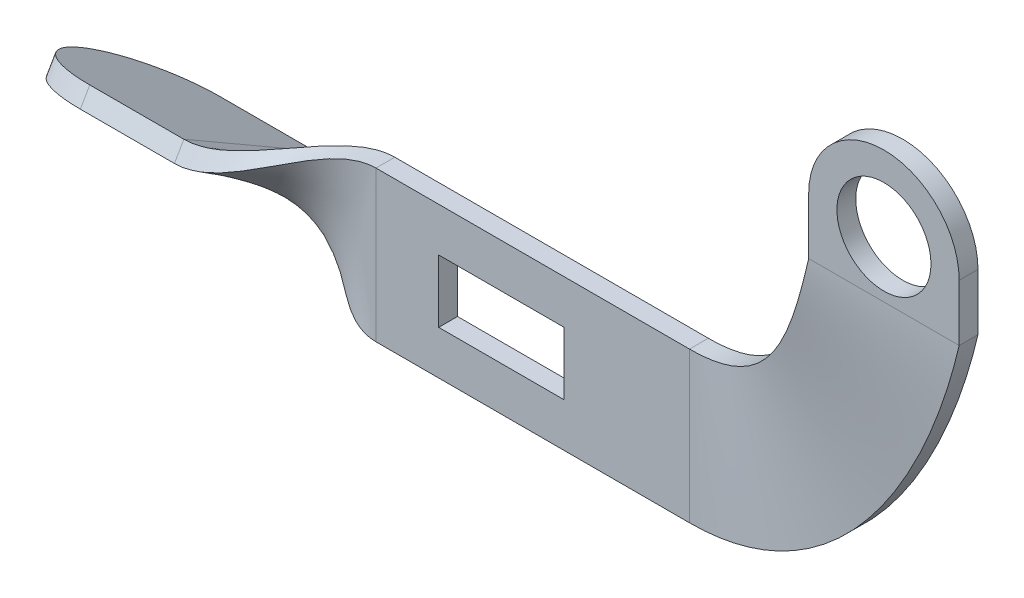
ISO-10303-21;
HEADER;
FILE_DESCRIPTION(('STEP AP214'),'2;1');
FILE_NAME('part.step','',(''),(''),'','','');
FILE_SCHEMA(('AUTOMOTIVE_DESIGN { 1 0 10303 214 1 1 1 1 }'));
ENDSEC;
DATA;
#1=APPLICATION_CONTEXT('core data for automotive mechanical design processes');
#2=APPLICATION_PROTOCOL_DEFINITION('international standard','automotive_design',2000,#1);
#3=PRODUCT_CONTEXT('',#1,'mechanical');
#4=PRODUCT('Part','Part','',(#3));
#5=PRODUCT_RELATED_PRODUCT_CATEGORY('part','',(#4));
#6=PRODUCT_DEFINITION_FORMATION('','',#4);
#7=PRODUCT_DEFINITION_CONTEXT('part definition',#1,'design');
#8=PRODUCT_DEFINITION('design','',#6,#7);
#9=PRODUCT_DEFINITION_SHAPE('','',#8);
#10=(LENGTH_UNIT() NAMED_UNIT(*) SI_UNIT(.MILLI.,.METRE.));
#11=(NAMED_UNIT(*) PLANE_ANGLE_UNIT() SI_UNIT($,.RADIAN.));
#12=(NAMED_UNIT(*) SI_UNIT($,.STERADIAN.) SOLID_ANGLE_UNIT());
#13=UNCERTAINTY_MEASURE_WITH_UNIT(LENGTH_MEASURE(1.E-05),#10,'distance_accuracy_value','');
#14=(GEOMETRIC_REPRESENTATION_CONTEXT(3) GLOBAL_UNCERTAINTY_ASSIGNED_CONTEXT((#13)) GLOBAL_UNIT_ASSIGNED_CONTEXT((#10,
#11,#12)) REPRESENTATION_CONTEXT('',''));
#15=CARTESIAN_POINT('',(0.,0.,0.));
#16=DIRECTION('',(0.,0.,1.));
#17=DIRECTION('',(1.,0.,0.));
#18=AXIS2_PLACEMENT_3D('',#15,#16,#17);
#19=CARTESIAN_POINT('',(0.,24.,60.5226466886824));
#20=DIRECTION('',(0.,0.,1.));
#21=DIRECTION('',(-1.,0.,0.));
#22=AXIS2_PLACEMENT_3D('',#19,#20,#21);
#23=PLANE('',#22);
#24=DIRECTION('',(0.,-1.,0.));
#25=VECTOR('',#24,1.);
#26=CARTESIAN_POINT('',(0.,0.,60.5226466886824));
#27=LINE('',#26,#25);
#28=CARTESIAN_POINT('',(0.,24.,60.5226466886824));
#29=VERTEX_POINT('',#28);
#30=CARTESIAN_POINT('',(0.,0.,60.5226466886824));
#31=VERTEX_POINT('',#30);
#32=EDGE_CURVE('E287',#29,#31,#27,.T.);
#33=ORIENTED_EDGE('',*,*,#32,.F.);
#34=DIRECTION('',(-1.,0.,0.));
#35=VECTOR('',#34,1.);
#36=CARTESIAN_POINT('',(0.,24.,60.5226466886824));
#37=LINE('',#36,#35);
#38=CARTESIAN_POINT('',(50.,24.,60.5226466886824));
#39=VERTEX_POINT('',#38);
#40=EDGE_CURVE('E296',#39,#29,#37,.T.);
#41=ORIENTED_EDGE('',*,*,#40,.F.);
#42=DIRECTION('',(0.,1.,0.));
#43=VECTOR('',#42,1.);
#44=CARTESIAN_POINT('',(50.,0.,60.5226466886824));
#45=LINE('',#44,#43);
#46=CARTESIAN_POINT('',(50.,0.,60.5226466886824));
#47=VERTEX_POINT('',#46);
#48=EDGE_CURVE('E293',#47,#39,#45,.T.);
#49=ORIENTED_EDGE('',*,*,#48,.F.);
#50=DIRECTION('',(1.,0.,0.));
#51=VECTOR('',#50,1.);
#52=CARTESIAN_POINT('',(0.,0.,60.5226466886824));
#53=LINE('',#52,#51);
#54=EDGE_CURVE('E289',#31,#47,#53,.T.);
#55=ORIENTED_EDGE('',*,*,#54,.F.);
#56=EDGE_LOOP('',(#33,#41,#49,#55));
#57=FACE_BOUND('',#56,.T.);
#58=DIRECTION('',(0.,-1.,0.));
#59=VECTOR('',#58,1.);
#60=CARTESIAN_POINT('',(10.,17.,60.5226466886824));
#61=LINE('',#60,#59);
#62=CARTESIAN_POINT('',(10.,17.,60.5226466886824));
#63=VERTEX_POINT('',#62);
#64=CARTESIAN_POINT('',(10.,7.,60.5226466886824));
#65=VERTEX_POINT('',#64);
#66=EDGE_CURVE('E259',#63,#65,#61,.T.);
#67=ORIENTED_EDGE('',*,*,#66,.T.);
#68=DIRECTION('',(1.,0.,0.));
#69=VECTOR('',#68,1.);
#70=CARTESIAN_POINT('',(10.,7.,60.5226466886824));
#71=LINE('',#70,#69);
#72=CARTESIAN_POINT('',(30.,7.,60.5226466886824));
#73=VERTEX_POINT('',#72);
#74=EDGE_CURVE('E262',#65,#73,#71,.T.);
#75=ORIENTED_EDGE('',*,*,#74,.T.);
#76=DIRECTION('',(0.,1.,0.));
#77=VECTOR('',#76,1.);
#78=CARTESIAN_POINT('',(30.,17.,60.5226466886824));
#79=LINE('',#78,#77);
#80=CARTESIAN_POINT('',(30.,17.,60.5226466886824));
#81=VERTEX_POINT('',#80);
#82=EDGE_CURVE('E266',#73,#81,#79,.T.);
#83=ORIENTED_EDGE('',*,*,#82,.T.);
#84=DIRECTION('',(-1.,0.,0.));
#85=VECTOR('',#84,1.);
#86=CARTESIAN_POINT('',(10.,17.,60.5226466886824));
#87=LINE('',#86,#85);
#88=EDGE_CURVE('E269',#81,#63,#87,.T.);
#89=ORIENTED_EDGE('',*,*,#88,.T.);
#90=EDGE_LOOP('',(#67,#75,#83,#89));
#91=FACE_BOUND('',#90,.T.);
#92=ADVANCED_FACE('F31',(#57,#91),#23,.F.);
#93=CARTESIAN_POINT('',(0.,24.,63.5226466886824));
#94=DIRECTION('',(0.,0.,1.));
#95=DIRECTION('',(-1.,0.,0.));
#96=AXIS2_PLACEMENT_3D('',#93,#94,#95);
#97=PLANE('',#96);
#98=DIRECTION('',(0.,-1.,0.));
#99=VECTOR('',#98,1.);
#100=CARTESIAN_POINT('',(0.,0.,63.5226466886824));
#101=LINE('',#100,#99);
#102=CARTESIAN_POINT('',(0.,24.,63.5226466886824));
#103=VERTEX_POINT('',#102);
#104=CARTESIAN_POINT('',(0.,0.,63.5226466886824));
#105=VERTEX_POINT('',#104);
#106=EDGE_CURVE('E286',#103,#105,#101,.T.);
#107=ORIENTED_EDGE('',*,*,#106,.T.);
#108=DIRECTION('',(1.,0.,0.));
#109=VECTOR('',#108,1.);
#110=CARTESIAN_POINT('',(0.,0.,63.5226466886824));
#111=LINE('',#110,#109);
#112=CARTESIAN_POINT('',(50.,0.,63.5226466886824));
#113=VERTEX_POINT('',#112);
#114=EDGE_CURVE('E300',#105,#113,#111,.T.);
#115=ORIENTED_EDGE('',*,*,#114,.T.);
#116=DIRECTION('',(0.,1.,0.));
#117=VECTOR('',#116,1.);
#118=CARTESIAN_POINT('',(50.,0.,63.5226466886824));
#119=LINE('',#118,#117);
#120=CARTESIAN_POINT('',(50.,24.,63.5226466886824));
#121=VERTEX_POINT('',#120);
#122=EDGE_CURVE('E303',#113,#121,#119,.T.);
#123=ORIENTED_EDGE('',*,*,#122,.T.);
#124=DIRECTION('',(-1.,0.,0.));
#125=VECTOR('',#124,1.);
#126=CARTESIAN_POINT('',(0.,24.,63.5226466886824));
#127=LINE('',#126,#125);
#128=EDGE_CURVE('E290',#121,#103,#127,.T.);
#129=ORIENTED_EDGE('',*,*,#128,.T.);
#130=EDGE_LOOP('',(#107,#115,#123,#129));
#131=FACE_BOUND('',#130,.T.);
#132=DIRECTION('',(-1.,0.,0.));
#133=VECTOR('',#132,1.);
#134=CARTESIAN_POINT('',(10.,17.,63.5226466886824));
#135=LINE('',#134,#133);
#136=CARTESIAN_POINT('',(30.,17.,63.5226466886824));
#137=VERTEX_POINT('',#136);
#138=CARTESIAN_POINT('',(10.,17.,63.5226466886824));
#139=VERTEX_POINT('',#138);
#140=EDGE_CURVE('E263',#137,#139,#135,.T.);
#141=ORIENTED_EDGE('',*,*,#140,.F.);
#142=DIRECTION('',(0.,1.,0.));
#143=VECTOR('',#142,1.);
#144=CARTESIAN_POINT('',(30.,17.,63.5226466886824));
#145=LINE('',#144,#143);
#146=CARTESIAN_POINT('',(30.,7.,63.5226466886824));
#147=VERTEX_POINT('',#146);
#148=EDGE_CURVE('E276',#147,#137,#145,.T.);
#149=ORIENTED_EDGE('',*,*,#148,.F.);
#150=DIRECTION('',(1.,0.,0.));
#151=VECTOR('',#150,1.);
#152=CARTESIAN_POINT('',(10.,7.,63.5226466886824));
#153=LINE('',#152,#151);
#154=CARTESIAN_POINT('',(10.,7.,63.5226466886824));
#155=VERTEX_POINT('',#154);
#156=EDGE_CURVE('E273',#155,#147,#153,.T.);
#157=ORIENTED_EDGE('',*,*,#156,.F.);
#158=DIRECTION('',(0.,-1.,0.));
#159=VECTOR('',#158,1.);
#160=CARTESIAN_POINT('',(10.,17.,63.5226466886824));
#161=LINE('',#160,#159);
#162=EDGE_CURVE('E252',#139,#155,#161,.T.);
#163=ORIENTED_EDGE('',*,*,#162,.F.);
#164=EDGE_LOOP('',(#141,#149,#157,#163));
#165=FACE_BOUND('',#164,.T.);
#166=ADVANCED_FACE('F327',(#131,#165),#97,.T.);
#167=CARTESIAN_POINT('',(0.,0.,60.5226466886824));
#168=DIRECTION('',(0.,1.,0.));
#169=DIRECTION('',(0.,0.,-1.));
#170=AXIS2_PLACEMENT_3D('',#167,#168,#169);
#171=PLANE('',#170);
#172=ORIENTED_EDGE('',*,*,#114,.F.);
#173=DIRECTION('',(0.,0.,1.));
#174=VECTOR('',#173,1.);
#175=CARTESIAN_POINT('',(0.,0.,60.5226466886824));
#176=LINE('',#175,#174);
#177=EDGE_CURVE('E11',#31,#105,#176,.T.);
#178=ORIENTED_EDGE('',*,*,#177,.F.);
#179=ORIENTED_EDGE('',*,*,#54,.T.);
#180=DIRECTION('',(0.,0.,1.));
#181=VECTOR('',#180,1.);
#182=CARTESIAN_POINT('',(50.,0.,60.5226466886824));
#183=LINE('',#182,#181);
#184=EDGE_CURVE('E39',#47,#113,#183,.T.);
#185=ORIENTED_EDGE('',*,*,#184,.T.);
#186=EDGE_LOOP('',(#172,#178,#179,#185));
#187=FACE_BOUND('',#186,.T.);
#188=ADVANCED_FACE('F33',(#187),#171,.F.);
#189=CARTESIAN_POINT('',(0.,24.,60.5226466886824));
#190=DIRECTION('',(0.,-1.,0.));
#191=DIRECTION('',(0.,0.,1.));
#192=AXIS2_PLACEMENT_3D('',#189,#190,#191);
#193=PLANE('',#192);
#194=ORIENTED_EDGE('',*,*,#128,.F.);
#195=DIRECTION('',(0.,0.,1.));
#196=VECTOR('',#195,1.);
#197=CARTESIAN_POINT('',(50.,24.,60.5226466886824));
#198=LINE('',#197,#196);
#199=EDGE_CURVE('E309',#39,#121,#198,.T.);
#200=ORIENTED_EDGE('',*,*,#199,.F.);
#201=ORIENTED_EDGE('',*,*,#40,.T.);
#202=DIRECTION('',(0.,0.,1.));
#203=VECTOR('',#202,1.);
#204=CARTESIAN_POINT('',(0.,24.,60.5226466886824));
#205=LINE('',#204,#203);
#206=EDGE_CURVE('E172',#29,#103,#205,.T.);
#207=ORIENTED_EDGE('',*,*,#206,.T.);
#208=EDGE_LOOP('',(#194,#200,#201,#207));
#209=FACE_BOUND('',#208,.T.);
#210=ADVANCED_FACE('F367',(#209),#193,.F.);
#211=CARTESIAN_POINT('',(10.,17.,60.5226466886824));
#212=DIRECTION('',(1.,0.,0.));
#213=DIRECTION('',(0.,0.,1.));
#214=AXIS2_PLACEMENT_3D('',#211,#212,#213);
#215=PLANE('',#214);
#216=ORIENTED_EDGE('',*,*,#162,.T.);
#217=DIRECTION('',(0.,0.,1.));
#218=VECTOR('',#217,1.);
#219=CARTESIAN_POINT('',(10.,7.,60.5226466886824));
#220=LINE('',#219,#218);
#221=EDGE_CURVE('E284',#65,#155,#220,.T.);
#222=ORIENTED_EDGE('',*,*,#221,.F.);
#223=ORIENTED_EDGE('',*,*,#66,.F.);
#224=DIRECTION('',(0.,0.,1.));
#225=VECTOR('',#224,1.);
#226=CARTESIAN_POINT('',(10.,17.,60.5226466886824));
#227=LINE('',#226,#225);
#228=EDGE_CURVE('E54',#63,#139,#227,.T.);
#229=ORIENTED_EDGE('',*,*,#228,.T.);
#230=EDGE_LOOP('',(#216,#222,#223,#229));
#231=FACE_BOUND('',#230,.T.);
#232=ADVANCED_FACE('F369',(#231),#215,.T.);
#233=CARTESIAN_POINT('',(10.,7.,60.5226466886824));
#234=DIRECTION('',(0.,1.,0.));
#235=DIRECTION('',(0.,0.,-1.));
#236=AXIS2_PLACEMENT_3D('',#233,#234,#235);
#237=PLANE('',#236);
#238=ORIENTED_EDGE('',*,*,#156,.T.);
#239=DIRECTION('',(0.,0.,1.));
#240=VECTOR('',#239,1.);
#241=CARTESIAN_POINT('',(30.,7.,60.5226466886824));
#242=LINE('',#241,#240);
#243=EDGE_CURVE('E282',#73,#147,#242,.T.);
#244=ORIENTED_EDGE('',*,*,#243,.F.);
#245=ORIENTED_EDGE('',*,*,#74,.F.);
#246=ORIENTED_EDGE('',*,*,#221,.T.);
#247=EDGE_LOOP('',(#238,#244,#245,#246));
#248=FACE_BOUND('',#247,.T.);
#249=ADVANCED_FACE('F374',(#248),#237,.T.);
#250=CARTESIAN_POINT('',(30.,17.,60.5226466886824));
#251=DIRECTION('',(-1.,0.,0.));
#252=DIRECTION('',(0.,0.,-1.));
#253=AXIS2_PLACEMENT_3D('',#250,#251,#252);
#254=PLANE('',#253);
#255=ORIENTED_EDGE('',*,*,#148,.T.);
#256=DIRECTION('',(0.,0.,1.));
#257=VECTOR('',#256,1.);
#258=CARTESIAN_POINT('',(30.,17.,60.5226466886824));
#259=LINE('',#258,#257);
#260=EDGE_CURVE('E46',#81,#137,#259,.T.);
#261=ORIENTED_EDGE('',*,*,#260,.F.);
#262=ORIENTED_EDGE('',*,*,#82,.F.);
#263=ORIENTED_EDGE('',*,*,#243,.T.);
#264=EDGE_LOOP('',(#255,#261,#262,#263));
#265=FACE_BOUND('',#264,.T.);
#266=ADVANCED_FACE('F385',(#265),#254,.T.);
#267=CARTESIAN_POINT('',(10.,17.,60.5226466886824));
#268=DIRECTION('',(0.,-1.,0.));
#269=DIRECTION('',(0.,0.,1.));
#270=AXIS2_PLACEMENT_3D('',#267,#268,#269);
#271=PLANE('',#270);
#272=ORIENTED_EDGE('',*,*,#140,.T.);
#273=ORIENTED_EDGE('',*,*,#228,.F.);
#274=ORIENTED_EDGE('',*,*,#88,.F.);
#275=ORIENTED_EDGE('',*,*,#260,.T.);
#276=EDGE_LOOP('',(#272,#273,#274,#275));
#277=FACE_BOUND('',#276,.T.);
#278=ADVANCED_FACE('F389',(#277),#271,.T.);
#279=CARTESIAN_POINT('',(79.,56.,73.5226466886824));
#280=CARTESIAN_POINT('',(75.8125972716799,42.4651832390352,73.5226466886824));
#281=CARTESIAN_POINT('',(62.7323307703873,24.,63.5226466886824));
#282=CARTESIAN_POINT('',(50.,24.,63.5226466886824));
#283=CARTESIAN_POINT('',(81.,56.,73.5226466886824));
#284=CARTESIAN_POINT('',(77.6125411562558,41.615675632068,73.5226466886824));
#285=CARTESIAN_POINT('',(63.5510503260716,22.,63.5226466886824));
#286=CARTESIAN_POINT('',(50.,22.,63.5226466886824));
#287=CARTESIAN_POINT('',(85.0000000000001,56.,73.5226466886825));
#288=CARTESIAN_POINT('',(81.2124289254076,39.9166604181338,73.5226466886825));
#289=CARTESIAN_POINT('',(65.1884894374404,18.,63.5226466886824));
#290=CARTESIAN_POINT('',(50.,18.,63.5226466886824));
#291=CARTESIAN_POINT('',(90.9999999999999,56.,73.5226466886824));
#292=CARTESIAN_POINT('',(86.6089116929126,37.3539170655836,73.5226466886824));
#293=CARTESIAN_POINT('',(67.659257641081,12.,63.5226466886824));
#294=CARTESIAN_POINT('',(50.,12.,63.5226466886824));
#295=CARTESIAN_POINT('',(97.0000000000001,56.,73.5226466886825));
#296=CARTESIAN_POINT('',(92.0042255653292,34.7862101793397,73.5226466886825));
#297=CARTESIAN_POINT('',(70.135125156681,5.99999999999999,63.5226466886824));
#298=CARTESIAN_POINT('',(50.,5.99999999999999,63.5226466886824));
#299=CARTESIAN_POINT('',(101.,56.,73.5226466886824));
#300=CARTESIAN_POINT('',(95.6002466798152,33.0707758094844,73.5226466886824));
#301=CARTESIAN_POINT('',(71.7894325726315,2.,63.5226466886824));
#302=CARTESIAN_POINT('',(50.,2.,63.5226466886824));
#303=CARTESIAN_POINT('',(103.,56.,73.5226466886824));
#304=CARTESIAN_POINT('',(97.3982572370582,32.2130586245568,73.5226466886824));
#305=CARTESIAN_POINT('',(72.6165862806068,0.,63.5226466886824));
#306=CARTESIAN_POINT('',(50.,0.,63.5226466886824));
#307=B_SPLINE_SURFACE_WITH_KNOTS('',3,3,((#279,#280,#281,#282),(#283,#284,#285,#286),(#287,#288,
#289,#290),(#291,#292,#293,#294),(#295,#296,#297,#298),(#299,#300,#301,#302),(#303,#304,#305,
#306)),.UNSPECIFIED.,.F.,.F.,.F.,(4,1,1,1,4),(4,4),(0.,0.25,0.5,0.75,1.),(0.,1.),.UNSPECIFIED.);
#308=DIRECTION('',(1.,0.,0.));
#309=VECTOR('',#308,1.);
#310=CARTESIAN_POINT('',(90.9999999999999,56.,73.5226466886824));
#311=LINE('',#310,#309);
#312=CARTESIAN_POINT('',(79.,56.,73.5226466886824));
#313=VERTEX_POINT('',#312);
#314=CARTESIAN_POINT('',(103.,56.,73.5226466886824));
#315=VERTEX_POINT('',#314);
#316=EDGE_CURVE('E230',#313,#315,#311,.T.);
#317=CARTESIAN_POINT('',(79.,56.,73.5226466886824));
#318=CARTESIAN_POINT('',(75.8125972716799,42.4651832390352,73.5226466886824));
#319=CARTESIAN_POINT('',(62.7323307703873,24.,63.5226466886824));
#320=CARTESIAN_POINT('',(50.,24.,63.5226466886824));
#321=B_SPLINE_CURVE_WITH_KNOTS('',3,(#317,#318,#319,#320),.UNSPECIFIED.,.F.,.F.,(4,4),(0.,1.),.UNSPECIFIED.);
#322=EDGE_CURVE('E218',#313,#121,#321,.T.);
#323=CARTESIAN_POINT('',(103.,56.,73.5226466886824));
#324=CARTESIAN_POINT('',(97.3982572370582,32.2130586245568,73.5226466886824));
#325=CARTESIAN_POINT('',(72.6165862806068,0.,63.5226466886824));
#326=CARTESIAN_POINT('',(50.,0.,63.5226466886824));
#327=B_SPLINE_CURVE_WITH_KNOTS('',3,(#323,#324,#325,#326),.UNSPECIFIED.,.F.,.F.,(4,4),(0.,1.),.UNSPECIFIED.);
#328=EDGE_CURVE('E223',#315,#113,#327,.T.);
#329=ORIENTED_EDGE('',*,*,#316,.F.);
#330=ORIENTED_EDGE('',*,*,#322,.T.);
#331=ORIENTED_EDGE('',*,*,#122,.F.);
#332=ORIENTED_EDGE('',*,*,#328,.F.);
#333=EDGE_LOOP('',(#329,#330,#331,#332));
#334=FACE_BOUND('',#333,.T.);
#335=ADVANCED_FACE('F324',(#334),#307,.F.);
#336=CARTESIAN_POINT('',(103.,56.,73.5226466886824));
#337=CARTESIAN_POINT('',(97.3982572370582,32.2130586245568,73.5226466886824));
#338=CARTESIAN_POINT('',(72.6165862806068,0.,63.5226466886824));
#339=CARTESIAN_POINT('',(50.,0.,63.5226466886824));
#340=CARTESIAN_POINT('',(103.,56.,73.2726466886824));
#341=CARTESIAN_POINT('',(97.3982572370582,32.2130586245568,73.2726466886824));
#342=CARTESIAN_POINT('',(72.6165862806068,0.,63.2726466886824));
#343=CARTESIAN_POINT('',(50.,0.,63.2726466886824));
#344=CARTESIAN_POINT('',(103.,56.,72.7726466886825));
#345=CARTESIAN_POINT('',(97.3982572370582,32.2130586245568,72.7726466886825));
#346=CARTESIAN_POINT('',(72.6165862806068,0.,62.7726466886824));
#347=CARTESIAN_POINT('',(50.,0.,62.7726466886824));
#348=CARTESIAN_POINT('',(103.,56.,72.0226466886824));
#349=CARTESIAN_POINT('',(97.3982572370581,32.2130586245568,72.0226466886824));
#350=CARTESIAN_POINT('',(72.6165862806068,0.,62.0226466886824));
#351=CARTESIAN_POINT('',(50.,0.,62.0226466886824));
#352=CARTESIAN_POINT('',(103.,56.,71.2726466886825));
#353=CARTESIAN_POINT('',(97.3982572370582,32.2130586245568,71.2726466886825));
#354=CARTESIAN_POINT('',(72.6165862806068,0.,61.2726466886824));
#355=CARTESIAN_POINT('',(50.,0.,61.2726466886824));
#356=CARTESIAN_POINT('',(103.,56.,70.7726466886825));
#357=CARTESIAN_POINT('',(97.3982572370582,32.2130586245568,70.7726466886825));
#358=CARTESIAN_POINT('',(72.6165862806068,0.,60.7726466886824));
#359=CARTESIAN_POINT('',(50.,0.,60.7726466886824));
#360=CARTESIAN_POINT('',(103.,56.,70.5226466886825));
#361=CARTESIAN_POINT('',(97.3982572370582,32.2130586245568,70.5226466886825));
#362=CARTESIAN_POINT('',(72.6165862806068,0.,60.5226466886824));
#363=CARTESIAN_POINT('',(50.,0.,60.5226466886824));
#364=B_SPLINE_SURFACE_WITH_KNOTS('',3,3,((#336,#337,#338,#339),(#340,#341,#342,#343),(#344,#345,
#346,#347),(#348,#349,#350,#351),(#352,#353,#354,#355),(#356,#357,#358,#359),(#360,#361,#362,
#363)),.UNSPECIFIED.,.F.,.F.,.F.,(4,1,1,1,4),(4,4),(0.,0.25,0.5,0.75,1.),(0.,1.),.UNSPECIFIED.);
#365=DIRECTION('',(0.,0.,-1.));
#366=VECTOR('',#365,1.);
#367=CARTESIAN_POINT('',(103.,56.,72.0226466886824));
#368=LINE('',#367,#366);
#369=CARTESIAN_POINT('',(103.,56.,70.5226466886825));
#370=VERTEX_POINT('',#369);
#371=EDGE_CURVE('E231',#315,#370,#368,.T.);
#372=CARTESIAN_POINT('',(103.,56.,70.5226466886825));
#373=CARTESIAN_POINT('',(97.3982572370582,32.2130586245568,70.5226466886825));
#374=CARTESIAN_POINT('',(72.6165862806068,0.,60.5226466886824));
#375=CARTESIAN_POINT('',(50.,0.,60.5226466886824));
#376=B_SPLINE_CURVE_WITH_KNOTS('',3,(#372,#373,#374,#375),.UNSPECIFIED.,.F.,.F.,(4,4),(0.,1.),.UNSPECIFIED.);
#377=EDGE_CURVE('E232',#370,#47,#376,.T.);
#378=ORIENTED_EDGE('',*,*,#371,.F.);
#379=ORIENTED_EDGE('',*,*,#328,.T.);
#380=ORIENTED_EDGE('',*,*,#184,.F.);
#381=ORIENTED_EDGE('',*,*,#377,.F.);
#382=EDGE_LOOP('',(#378,#379,#380,#381));
#383=FACE_BOUND('',#382,.T.);
#384=ADVANCED_FACE('F348',(#383),#364,.F.);
#385=CARTESIAN_POINT('',(103.,56.,70.5226466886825));
#386=CARTESIAN_POINT('',(97.3982572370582,32.2130586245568,70.5226466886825));
#387=CARTESIAN_POINT('',(72.6165862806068,0.,60.5226466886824));
#388=CARTESIAN_POINT('',(50.,0.,60.5226466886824));
#389=CARTESIAN_POINT('',(101.,56.,70.5226466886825));
#390=CARTESIAN_POINT('',(95.6002466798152,33.0707758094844,70.5226466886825));
#391=CARTESIAN_POINT('',(71.7894325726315,2.,60.5226466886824));
#392=CARTESIAN_POINT('',(50.,2.,60.5226466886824));
#393=CARTESIAN_POINT('',(97.0000000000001,56.,70.5226466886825));
#394=CARTESIAN_POINT('',(92.0042255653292,34.7862101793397,70.5226466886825));
#395=CARTESIAN_POINT('',(70.135125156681,6.,60.5226466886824));
#396=CARTESIAN_POINT('',(50.,6.,60.5226466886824));
#397=CARTESIAN_POINT('',(90.9999999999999,56.,70.5226466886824));
#398=CARTESIAN_POINT('',(86.6089116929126,37.3539170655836,70.5226466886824));
#399=CARTESIAN_POINT('',(67.659257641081,12.,60.5226466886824));
#400=CARTESIAN_POINT('',(50.,12.,60.5226466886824));
#401=CARTESIAN_POINT('',(85.,56.,70.5226466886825));
#402=CARTESIAN_POINT('',(81.2124289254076,39.9166604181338,70.5226466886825));
#403=CARTESIAN_POINT('',(65.1884894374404,18.,60.5226466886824));
#404=CARTESIAN_POINT('',(50.,18.,60.5226466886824));
#405=CARTESIAN_POINT('',(81.,56.,70.5226466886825));
#406=CARTESIAN_POINT('',(77.6125411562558,41.615675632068,70.5226466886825));
#407=CARTESIAN_POINT('',(63.5510503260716,22.,60.5226466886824));
#408=CARTESIAN_POINT('',(50.,22.,60.5226466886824));
#409=CARTESIAN_POINT('',(79.,56.,70.5226466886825));
#410=CARTESIAN_POINT('',(75.8125972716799,42.4651832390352,70.5226466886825));
#411=CARTESIAN_POINT('',(62.7323307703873,24.,60.5226466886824));
#412=CARTESIAN_POINT('',(50.,24.,60.5226466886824));
#413=B_SPLINE_SURFACE_WITH_KNOTS('',3,3,((#385,#386,#387,#388),(#389,#390,#391,#392),(#393,#394,
#395,#396),(#397,#398,#399,#400),(#401,#402,#403,#404),(#405,#406,#407,#408),(#409,#410,#411,
#412)),.UNSPECIFIED.,.F.,.F.,.F.,(4,1,1,1,4),(4,4),(0.,0.25,0.5,0.75,1.),(0.,1.),.UNSPECIFIED.);
#414=DIRECTION('',(-1.,0.,0.));
#415=VECTOR('',#414,1.);
#416=CARTESIAN_POINT('',(90.9999999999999,56.,70.5226466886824));
#417=LINE('',#416,#415);
#418=CARTESIAN_POINT('',(79.,56.,70.5226466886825));
#419=VERTEX_POINT('',#418);
#420=EDGE_CURVE('E239',#370,#419,#417,.T.);
#421=CARTESIAN_POINT('',(79.,56.,70.5226466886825));
#422=CARTESIAN_POINT('',(75.8125972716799,42.4651832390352,70.5226466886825));
#423=CARTESIAN_POINT('',(62.7323307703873,24.,60.5226466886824));
#424=CARTESIAN_POINT('',(50.,24.,60.5226466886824));
#425=B_SPLINE_CURVE_WITH_KNOTS('',3,(#421,#422,#423,#424),.UNSPECIFIED.,.F.,.F.,(4,4),(0.,1.),.UNSPECIFIED.);
#426=EDGE_CURVE('E240',#419,#39,#425,.T.);
#427=ORIENTED_EDGE('',*,*,#420,.F.);
#428=ORIENTED_EDGE('',*,*,#377,.T.);
#429=ORIENTED_EDGE('',*,*,#48,.T.);
#430=ORIENTED_EDGE('',*,*,#426,.F.);
#431=EDGE_LOOP('',(#427,#428,#429,#430));
#432=FACE_BOUND('',#431,.T.);
#433=ADVANCED_FACE('F346',(#432),#413,.F.);
#434=CARTESIAN_POINT('',(79.,56.,70.5226466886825));
#435=CARTESIAN_POINT('',(75.8125972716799,42.4651832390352,70.5226466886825));
#436=CARTESIAN_POINT('',(62.7323307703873,24.,60.5226466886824));
#437=CARTESIAN_POINT('',(50.,24.,60.5226466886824));
#438=CARTESIAN_POINT('',(79.,56.,70.7726466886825));
#439=CARTESIAN_POINT('',(75.8125972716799,42.4651832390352,70.7726466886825));
#440=CARTESIAN_POINT('',(62.7323307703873,24.,60.7726466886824));
#441=CARTESIAN_POINT('',(50.,24.,60.7726466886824));
#442=CARTESIAN_POINT('',(79.,56.,71.2726466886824));
#443=CARTESIAN_POINT('',(75.8125972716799,42.4651832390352,71.2726466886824));
#444=CARTESIAN_POINT('',(62.7323307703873,24.,61.2726466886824));
#445=CARTESIAN_POINT('',(50.,24.,61.2726466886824));
#446=CARTESIAN_POINT('',(78.9999999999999,56.,72.0226466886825));
#447=CARTESIAN_POINT('',(75.8125972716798,42.4651832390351,72.0226466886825));
#448=CARTESIAN_POINT('',(62.7323307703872,24.,62.0226466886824));
#449=CARTESIAN_POINT('',(50.,24.,62.0226466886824));
#450=CARTESIAN_POINT('',(79.,56.,72.7726466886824));
#451=CARTESIAN_POINT('',(75.8125972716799,42.4651832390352,72.7726466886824));
#452=CARTESIAN_POINT('',(62.7323307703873,24.,62.7726466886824));
#453=CARTESIAN_POINT('',(50.,24.,62.7726466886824));
#454=CARTESIAN_POINT('',(79.,56.,73.2726466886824));
#455=CARTESIAN_POINT('',(75.8125972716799,42.4651832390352,73.2726466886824));
#456=CARTESIAN_POINT('',(62.7323307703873,24.,63.2726466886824));
#457=CARTESIAN_POINT('',(50.,24.,63.2726466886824));
#458=CARTESIAN_POINT('',(79.,56.,73.5226466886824));
#459=CARTESIAN_POINT('',(75.8125972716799,42.4651832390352,73.5226466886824));
#460=CARTESIAN_POINT('',(62.7323307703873,24.,63.5226466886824));
#461=CARTESIAN_POINT('',(50.,24.,63.5226466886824));
#462=B_SPLINE_SURFACE_WITH_KNOTS('',3,3,((#434,#435,#436,#437),(#438,#439,#440,#441),(#442,#443,
#444,#445),(#446,#447,#448,#449),(#450,#451,#452,#453),(#454,#455,#456,#457),(#458,#459,#460,
#461)),.UNSPECIFIED.,.F.,.F.,.F.,(4,1,1,1,4),(4,4),(0.,0.25,0.5,0.75,1.),(0.,1.),.UNSPECIFIED.);
#463=DIRECTION('',(0.,0.,1.));
#464=VECTOR('',#463,1.);
#465=CARTESIAN_POINT('',(79.,56.,72.0226466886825));
#466=LINE('',#465,#464);
#467=EDGE_CURVE('E222',#419,#313,#466,.T.);
#468=ORIENTED_EDGE('',*,*,#467,.F.);
#469=ORIENTED_EDGE('',*,*,#426,.T.);
#470=ORIENTED_EDGE('',*,*,#199,.T.);
#471=ORIENTED_EDGE('',*,*,#322,.F.);
#472=EDGE_LOOP('',(#468,#469,#470,#471));
#473=FACE_BOUND('',#472,.T.);
#474=ADVANCED_FACE('F364',(#473),#462,.F.);
#475=CARTESIAN_POINT('',(91.,65.,70.5226466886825));
#476=DIRECTION('',(0.,0.,-1.));
#477=DIRECTION('',(1.,0.,0.));
#478=AXIS2_PLACEMENT_3D('',#475,#476,#477);
#479=PLANE('',#478);
#480=CARTESIAN_POINT('',(91.,65.,70.5226466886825));
#481=DIRECTION('',(0.,0.,1.));
#482=DIRECTION('',(1.,0.,0.));
#483=AXIS2_PLACEMENT_3D('',#480,#481,#482);
#484=CIRCLE('',#483,12.);
#485=CARTESIAN_POINT('',(103.,65.,70.5226466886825));
#486=VERTEX_POINT('',#485);
#487=CARTESIAN_POINT('',(79.,65.,70.5226466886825));
#488=VERTEX_POINT('',#487);
#489=EDGE_CURVE('E199',#486,#488,#484,.T.);
#490=ORIENTED_EDGE('',*,*,#489,.F.);
#491=DIRECTION('',(0.,1.,0.));
#492=VECTOR('',#491,1.);
#493=CARTESIAN_POINT('',(103.,65.,70.5226466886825));
#494=LINE('',#493,#492);
#495=EDGE_CURVE('E205',#370,#486,#494,.T.);
#496=ORIENTED_EDGE('',*,*,#495,.F.);
#497=ORIENTED_EDGE('',*,*,#420,.T.);
#498=DIRECTION('',(0.,-1.,0.));
#499=VECTOR('',#498,1.);
#500=CARTESIAN_POINT('',(79.,56.,70.5226466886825));
#501=LINE('',#500,#499);
#502=EDGE_CURVE('E202',#488,#419,#501,.T.);
#503=ORIENTED_EDGE('',*,*,#502,.F.);
#504=EDGE_LOOP('',(#490,#496,#497,#503));
#505=FACE_BOUND('',#504,.T.);
#506=CARTESIAN_POINT('',(91.,65.,70.5226466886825));
#507=DIRECTION('',(0.,0.,1.));
#508=DIRECTION('',(1.,0.,0.));
#509=AXIS2_PLACEMENT_3D('',#506,#507,#508);
#510=CIRCLE('',#509,7.5);
#511=CARTESIAN_POINT('',(98.5,65.,70.5226466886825));
#512=VERTEX_POINT('',#511);
#513=EDGE_CURVE('E182',#512,#512,#510,.T.);
#514=ORIENTED_EDGE('',*,*,#513,.T.);
#515=EDGE_LOOP('',(#514));
#516=FACE_BOUND('',#515,.T.);
#517=ADVANCED_FACE('F397',(#505,#516),#479,.T.);
#518=CARTESIAN_POINT('',(91.,65.,73.5226466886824));
#519=DIRECTION('',(0.,0.,-1.));
#520=DIRECTION('',(1.,0.,0.));
#521=AXIS2_PLACEMENT_3D('',#518,#519,#520);
#522=PLANE('',#521);
#523=CARTESIAN_POINT('',(91.,65.,73.5226466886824));
#524=DIRECTION('',(0.,0.,1.));
#525=DIRECTION('',(1.,0.,0.));
#526=AXIS2_PLACEMENT_3D('',#523,#524,#525);
#527=CIRCLE('',#526,12.);
#528=CARTESIAN_POINT('',(103.,65.,73.5226466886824));
#529=VERTEX_POINT('',#528);
#530=CARTESIAN_POINT('',(79.,65.,73.5226466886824));
#531=VERTEX_POINT('',#530);
#532=EDGE_CURVE('E197',#529,#531,#527,.T.);
#533=ORIENTED_EDGE('',*,*,#532,.T.);
#534=DIRECTION('',(0.,-1.,0.));
#535=VECTOR('',#534,1.);
#536=CARTESIAN_POINT('',(79.,56.,73.5226466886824));
#537=LINE('',#536,#535);
#538=EDGE_CURVE('E211',#531,#313,#537,.T.);
#539=ORIENTED_EDGE('',*,*,#538,.T.);
#540=ORIENTED_EDGE('',*,*,#316,.T.);
#541=DIRECTION('',(0.,1.,0.));
#542=VECTOR('',#541,1.);
#543=CARTESIAN_POINT('',(103.,65.,73.5226466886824));
#544=LINE('',#543,#542);
#545=EDGE_CURVE('E203',#315,#529,#544,.T.);
#546=ORIENTED_EDGE('',*,*,#545,.T.);
#547=EDGE_LOOP('',(#533,#539,#540,#546));
#548=FACE_BOUND('',#547,.T.);
#549=CARTESIAN_POINT('',(91.,65.,73.5226466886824));
#550=DIRECTION('',(0.,0.,1.));
#551=DIRECTION('',(1.,0.,0.));
#552=AXIS2_PLACEMENT_3D('',#549,#550,#551);
#553=CIRCLE('',#552,7.5);
#554=CARTESIAN_POINT('',(98.5,65.,73.5226466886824));
#555=VERTEX_POINT('',#554);
#556=EDGE_CURVE('E179',#555,#555,#553,.T.);
#557=ORIENTED_EDGE('',*,*,#556,.F.);
#558=EDGE_LOOP('',(#557));
#559=FACE_BOUND('',#558,.T.);
#560=ADVANCED_FACE('F354',(#548,#559),#522,.F.);
#561=CARTESIAN_POINT('',(91.,65.,70.5226466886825));
#562=DIRECTION('',(0.,0.,1.));
#563=DIRECTION('',(-1.,0.,0.));
#564=AXIS2_PLACEMENT_3D('',#561,#562,#563);
#565=CYLINDRICAL_SURFACE('',#564,12.);
#566=ORIENTED_EDGE('',*,*,#532,.F.);
#567=DIRECTION('',(0.,0.,1.));
#568=VECTOR('',#567,1.);
#569=CARTESIAN_POINT('',(103.,65.,70.5226466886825));
#570=LINE('',#569,#568);
#571=EDGE_CURVE('E208',#486,#529,#570,.T.);
#572=ORIENTED_EDGE('',*,*,#571,.F.);
#573=ORIENTED_EDGE('',*,*,#489,.T.);
#574=DIRECTION('',(0.,0.,1.));
#575=VECTOR('',#574,1.);
#576=CARTESIAN_POINT('',(79.,65.,70.5226466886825));
#577=LINE('',#576,#575);
#578=EDGE_CURVE('E216',#488,#531,#577,.T.);
#579=ORIENTED_EDGE('',*,*,#578,.T.);
#580=EDGE_LOOP('',(#566,#572,#573,#579));
#581=FACE_BOUND('',#580,.T.);
#582=ADVANCED_FACE('F357',(#581),#565,.T.);
#583=CARTESIAN_POINT('',(79.,56.,70.5226466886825));
#584=DIRECTION('',(1.,0.,0.));
#585=DIRECTION('',(0.,1.,0.));
#586=AXIS2_PLACEMENT_3D('',#583,#584,#585);
#587=PLANE('',#586);
#588=ORIENTED_EDGE('',*,*,#538,.F.);
#589=ORIENTED_EDGE('',*,*,#578,.F.);
#590=ORIENTED_EDGE('',*,*,#502,.T.);
#591=ORIENTED_EDGE('',*,*,#467,.T.);
#592=EDGE_LOOP('',(#588,#589,#590,#591));
#593=FACE_BOUND('',#592,.T.);
#594=ADVANCED_FACE('F361',(#593),#587,.F.);
#595=CARTESIAN_POINT('',(103.,65.,70.5226466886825));
#596=DIRECTION('',(-1.,0.,0.));
#597=DIRECTION('',(0.,0.,-1.));
#598=AXIS2_PLACEMENT_3D('',#595,#596,#597);
#599=PLANE('',#598);
#600=ORIENTED_EDGE('',*,*,#545,.F.);
#601=ORIENTED_EDGE('',*,*,#371,.T.);
#602=ORIENTED_EDGE('',*,*,#495,.T.);
#603=ORIENTED_EDGE('',*,*,#571,.T.);
#604=EDGE_LOOP('',(#600,#601,#602,#603));
#605=FACE_BOUND('',#604,.T.);
#606=ADVANCED_FACE('F350',(#605),#599,.F.);
#607=CARTESIAN_POINT('',(91.,65.,70.5226466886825));
#608=DIRECTION('',(0.,0.,1.));
#609=DIRECTION('',(-1.,0.,0.));
#610=AXIS2_PLACEMENT_3D('',#607,#608,#609);
#611=CYLINDRICAL_SURFACE('',#610,7.5);
#612=ORIENTED_EDGE('',*,*,#513,.F.);
#613=EDGE_LOOP('',(#612));
#614=FACE_BOUND('',#613,.T.);
#615=ORIENTED_EDGE('',*,*,#556,.T.);
#616=EDGE_LOOP('',(#615));
#617=FACE_BOUND('',#616,.T.);
#618=ADVANCED_FACE('F436',(#614,#617),#611,.F.);
#619=CARTESIAN_POINT('',(-24.,16.7009618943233,71.6649515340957));
#620=CARTESIAN_POINT('',(-15.5252560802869,16.7009618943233,71.6649515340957));
#621=CARTESIAN_POINT('',(-8.47474391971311,24.,63.5226466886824));
#622=CARTESIAN_POINT('',(0.,24.,63.5226466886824));
#623=CARTESIAN_POINT('',(-24.,16.9174682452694,71.5399515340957));
#624=CARTESIAN_POINT('',(-15.5291183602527,16.9174682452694,71.5399515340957));
#625=CARTESIAN_POINT('',(-8.47088163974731,24.,63.2726466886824));
#626=CARTESIAN_POINT('',(0.,24.,63.2726466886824));
#627=CARTESIAN_POINT('',(-24.,17.3504809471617,71.2899515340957));
#628=CARTESIAN_POINT('',(-15.5368429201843,17.3504809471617,71.2899515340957));
#629=CARTESIAN_POINT('',(-8.4631570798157,24.,62.7726466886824));
#630=CARTESIAN_POINT('',(0.,24.,62.7726466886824));
#631=CARTESIAN_POINT('',(-24.,18.,70.9149515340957));
#632=CARTESIAN_POINT('',(-15.5429576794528,18.,70.9149515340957));
#633=CARTESIAN_POINT('',(-8.4570423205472,24.,62.0226466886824));
#634=CARTESIAN_POINT('',(0.,24.,62.0226466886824));
#635=CARTESIAN_POINT('',(-24.,18.6495190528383,70.5399515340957));
#636=CARTESIAN_POINT('',(-15.5454035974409,18.6495190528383,70.5399515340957));
#637=CARTESIAN_POINT('',(-8.45459640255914,24.,61.2726466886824));
#638=CARTESIAN_POINT('',(0.,24.,61.2726466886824));
#639=CARTESIAN_POINT('',(-24.,19.0825317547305,70.2899515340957));
#640=CARTESIAN_POINT('',(-15.5433653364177,19.0825317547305,70.2899515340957));
#641=CARTESIAN_POINT('',(-8.45663466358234,24.,60.7726466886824));
#642=CARTESIAN_POINT('',(0.,24.,60.7726466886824));
#643=CARTESIAN_POINT('',(-24.,19.2990381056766,70.1649515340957));
#644=CARTESIAN_POINT('',(-15.5423462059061,19.2990381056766,70.1649515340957));
#645=CARTESIAN_POINT('',(-8.45765379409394,24.,60.5226466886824));
#646=CARTESIAN_POINT('',(0.,24.,60.5226466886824));
#647=B_SPLINE_SURFACE_WITH_KNOTS('',3,3,((#619,#620,#621,#622),(#623,#624,#625,#626),(#627,#628,
#629,#630),(#631,#632,#633,#634),(#635,#636,#637,#638),(#639,#640,#641,#642),(#643,#644,#645,
#646)),.UNSPECIFIED.,.F.,.F.,.F.,(4,1,1,1,4),(4,4),(0.,0.25,0.5,0.75,1.),(0.,1.),.UNSPECIFIED.);
#648=DIRECTION('',(0.,0.866025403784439,-0.499999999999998));
#649=VECTOR('',#648,1.);
#650=CARTESIAN_POINT('',(-24.,18.,70.9149515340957));
#651=LINE('',#650,#649);
#652=CARTESIAN_POINT('',(-24.,16.7009618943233,71.6649515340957));
#653=VERTEX_POINT('',#652);
#654=CARTESIAN_POINT('',(-24.,19.2990381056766,70.1649515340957));
#655=VERTEX_POINT('',#654);
#656=EDGE_CURVE('E170',#653,#655,#651,.T.);
#657=CARTESIAN_POINT('',(-24.,16.7009618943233,71.6649515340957));
#658=CARTESIAN_POINT('',(-15.5252560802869,16.7009618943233,71.6649515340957));
#659=CARTESIAN_POINT('',(-8.47474391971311,24.,63.5226466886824));
#660=CARTESIAN_POINT('',(0.,24.,63.5226466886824));
#661=B_SPLINE_CURVE_WITH_KNOTS('',3,(#657,#658,#659,#660),.UNSPECIFIED.,.F.,.F.,(4,4),(0.,1.),.UNSPECIFIED.);
#662=EDGE_CURVE('E195',#653,#103,#661,.T.);
#663=CARTESIAN_POINT('',(-24.,19.2990381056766,70.1649515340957));
#664=CARTESIAN_POINT('',(-15.5423462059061,19.2990381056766,70.1649515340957));
#665=CARTESIAN_POINT('',(-8.45765379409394,24.,60.5226466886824));
#666=CARTESIAN_POINT('',(0.,24.,60.5226466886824));
#667=B_SPLINE_CURVE_WITH_KNOTS('',3,(#663,#664,#665,#666),.UNSPECIFIED.,.F.,.F.,(4,4),(0.,1.),.UNSPECIFIED.);
#668=EDGE_CURVE('E163',#655,#29,#667,.T.);
#669=ORIENTED_EDGE('',*,*,#656,.F.);
#670=ORIENTED_EDGE('',*,*,#662,.T.);
#671=ORIENTED_EDGE('',*,*,#206,.F.);
#672=ORIENTED_EDGE('',*,*,#668,.F.);
#673=EDGE_LOOP('',(#669,#670,#671,#672));
#674=FACE_BOUND('',#673,.T.);
#675=ADVANCED_FACE('F169',(#674),#647,.F.);
#676=CARTESIAN_POINT('',(-24.,19.2990381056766,70.1649515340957));
#677=CARTESIAN_POINT('',(-15.5423462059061,19.2990381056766,70.1649515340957));
#678=CARTESIAN_POINT('',(-8.45765379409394,24.,60.5226466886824));
#679=CARTESIAN_POINT('',(0.,24.,60.5226466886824));
#680=CARTESIAN_POINT('',(-24.,18.2990381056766,68.4329007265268));
#681=CARTESIAN_POINT('',(-15.6832743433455,18.2990381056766,68.4329007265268));
#682=CARTESIAN_POINT('',(-8.31672565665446,22.,60.5226466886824));
#683=CARTESIAN_POINT('',(0.,22.,60.5226466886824));
#684=CARTESIAN_POINT('',(-24.,16.2990381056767,64.9687991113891));
#685=CARTESIAN_POINT('',(-15.9651306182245,16.2990381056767,64.9687991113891));
#686=CARTESIAN_POINT('',(-8.03486938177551,18.,60.5226466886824));
#687=CARTESIAN_POINT('',(0.,18.,60.5226466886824));
#688=CARTESIAN_POINT('',(-24.,13.2990381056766,59.7726466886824));
#689=CARTESIAN_POINT('',(-16.0360580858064,13.2990381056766,59.7726466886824));
#690=CARTESIAN_POINT('',(-7.96394191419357,12.,60.5226466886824));
#691=CARTESIAN_POINT('',(0.,12.,60.5226466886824));
#692=CARTESIAN_POINT('',(-24.,10.2990381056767,54.5764942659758));
#693=CARTESIAN_POINT('',(-15.8344418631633,10.2990381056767,54.5764942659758));
#694=CARTESIAN_POINT('',(-8.1655581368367,5.99999999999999,60.5226466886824));
#695=CARTESIAN_POINT('',(0.,5.99999999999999,60.5226466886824));
#696=CARTESIAN_POINT('',(-24.,8.29903810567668,51.112392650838));
#697=CARTESIAN_POINT('',(-15.4849975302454,8.29903810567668,51.112392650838));
#698=CARTESIAN_POINT('',(-8.51500246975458,2.,60.5226466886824));
#699=CARTESIAN_POINT('',(0.,2.,60.5226466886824));
#700=CARTESIAN_POINT('',(-24.,7.29903810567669,49.3803418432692));
#701=CARTESIAN_POINT('',(-15.3102753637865,7.29903810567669,49.3803418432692));
#702=CARTESIAN_POINT('',(-8.68972463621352,0.,60.5226466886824));
#703=CARTESIAN_POINT('',(0.,0.,60.5226466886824));
#704=B_SPLINE_SURFACE_WITH_KNOTS('',3,3,((#676,#677,#678,#679),(#680,#681,#682,#683),(#684,#685,
#686,#687),(#688,#689,#690,#691),(#692,#693,#694,#695),(#696,#697,#698,#699),(#700,#701,#702,
#703)),.UNSPECIFIED.,.F.,.F.,.F.,(4,1,1,1,4),(4,4),(0.,0.25,0.5,0.75,1.),(0.,1.),.UNSPECIFIED.);
#705=DIRECTION('',(0.,-0.499999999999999,-0.86602540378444));
#706=VECTOR('',#705,1.);
#707=CARTESIAN_POINT('',(-24.,13.2990381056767,59.7726466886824));
#708=LINE('',#707,#706);
#709=CARTESIAN_POINT('',(-24.,7.29903810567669,49.3803418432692));
#710=VERTEX_POINT('',#709);
#711=EDGE_CURVE('E149',#655,#710,#708,.T.);
#712=CARTESIAN_POINT('',(-24.,7.29903810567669,49.3803418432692));
#713=CARTESIAN_POINT('',(-15.3102753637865,7.29903810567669,49.3803418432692));
#714=CARTESIAN_POINT('',(-8.68972463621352,0.,60.5226466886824));
#715=CARTESIAN_POINT('',(0.,0.,60.5226466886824));
#716=B_SPLINE_CURVE_WITH_KNOTS('',3,(#712,#713,#714,#715),.UNSPECIFIED.,.F.,.F.,(4,4),(0.,1.),.UNSPECIFIED.);
#717=EDGE_CURVE('E165',#710,#31,#716,.T.);
#718=ORIENTED_EDGE('',*,*,#711,.F.);
#719=ORIENTED_EDGE('',*,*,#668,.T.);
#720=ORIENTED_EDGE('',*,*,#32,.T.);
#721=ORIENTED_EDGE('',*,*,#717,.F.);
#722=EDGE_LOOP('',(#718,#719,#720,#721));
#723=FACE_BOUND('',#722,.T.);
#724=ADVANCED_FACE('F161',(#723),#704,.F.);
#725=CARTESIAN_POINT('',(-24.,7.29903810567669,49.3803418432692));
#726=CARTESIAN_POINT('',(-15.3102753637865,7.29903810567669,49.3803418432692));
#727=CARTESIAN_POINT('',(-8.68972463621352,0.,60.5226466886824));
#728=CARTESIAN_POINT('',(0.,0.,60.5226466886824));
#729=CARTESIAN_POINT('',(-24.,7.08253175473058,49.5053418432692));
#730=CARTESIAN_POINT('',(-15.3112513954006,7.08253175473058,49.5053418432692));
#731=CARTESIAN_POINT('',(-8.68874860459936,0.,60.7726466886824));
#732=CARTESIAN_POINT('',(0.,0.,60.7726466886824));
#733=CARTESIAN_POINT('',(-24.,6.64951905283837,49.7553418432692));
#734=CARTESIAN_POINT('',(-15.313203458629,6.64951905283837,49.7553418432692));
#735=CARTESIAN_POINT('',(-8.68679654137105,0.,61.2726466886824));
#736=CARTESIAN_POINT('',(0.,0.,61.2726466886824));
#737=CARTESIAN_POINT('',(-24.,6.00000000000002,50.1303418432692));
#738=CARTESIAN_POINT('',(-15.3108609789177,6.00000000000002,50.1303418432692));
#739=CARTESIAN_POINT('',(-8.68913902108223,0.,62.0226466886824));
#740=CARTESIAN_POINT('',(0.,0.,62.0226466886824));
#741=CARTESIAN_POINT('',(-24.,5.35048094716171,50.5053418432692));
#742=CARTESIAN_POINT('',(-15.3050048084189,5.35048094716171,50.5053418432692));
#743=CARTESIAN_POINT('',(-8.6949951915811,0.,62.7726466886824));
#744=CARTESIAN_POINT('',(0.,0.,62.7726466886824));
#745=CARTESIAN_POINT('',(-24.,4.91746824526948,50.7553418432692));
#746=CARTESIAN_POINT('',(-15.2976052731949,4.91746824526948,50.7553418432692));
#747=CARTESIAN_POINT('',(-8.70239472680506,0.,63.2726466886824));
#748=CARTESIAN_POINT('',(0.,0.,63.2726466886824));
#749=CARTESIAN_POINT('',(-24.,4.70096189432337,50.8803418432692));
#750=CARTESIAN_POINT('',(-15.293905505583,4.70096189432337,50.8803418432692));
#751=CARTESIAN_POINT('',(-8.70609449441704,0.,63.5226466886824));
#752=CARTESIAN_POINT('',(0.,0.,63.5226466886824));
#753=B_SPLINE_SURFACE_WITH_KNOTS('',3,3,((#725,#726,#727,#728),(#729,#730,#731,#732),(#733,#734,
#735,#736),(#737,#738,#739,#740),(#741,#742,#743,#744),(#745,#746,#747,#748),(#749,#750,#751,
#752)),.UNSPECIFIED.,.F.,.F.,.F.,(4,1,1,1,4),(4,4),(0.,0.25,0.5,0.75,1.),(0.,1.),.UNSPECIFIED.);
#754=DIRECTION('',(0.,-0.866025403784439,0.499999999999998));
#755=VECTOR('',#754,1.);
#756=CARTESIAN_POINT('',(-24.,6.00000000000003,50.1303418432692));
#757=LINE('',#756,#755);
#758=CARTESIAN_POINT('',(-24.,4.70096189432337,50.8803418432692));
#759=VERTEX_POINT('',#758);
#760=EDGE_CURVE('E190',#710,#759,#757,.T.);
#761=CARTESIAN_POINT('',(-24.,4.70096189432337,50.8803418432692));
#762=CARTESIAN_POINT('',(-15.293905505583,4.70096189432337,50.8803418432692));
#763=CARTESIAN_POINT('',(-8.70609449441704,0.,63.5226466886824));
#764=CARTESIAN_POINT('',(0.,0.,63.5226466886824));
#765=B_SPLINE_CURVE_WITH_KNOTS('',3,(#761,#762,#763,#764),.UNSPECIFIED.,.F.,.F.,(4,4),(0.,1.),.UNSPECIFIED.);
#766=EDGE_CURVE('E185',#759,#105,#765,.T.);
#767=ORIENTED_EDGE('',*,*,#760,.F.);
#768=ORIENTED_EDGE('',*,*,#717,.T.);
#769=ORIENTED_EDGE('',*,*,#177,.T.);
#770=ORIENTED_EDGE('',*,*,#766,.F.);
#771=EDGE_LOOP('',(#767,#768,#769,#770));
#772=FACE_BOUND('',#771,.T.);
#773=ADVANCED_FACE('F338',(#772),#753,.F.);
#774=CARTESIAN_POINT('',(-24.,4.70096189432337,50.8803418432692));
#775=CARTESIAN_POINT('',(-15.293905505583,4.70096189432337,50.8803418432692));
#776=CARTESIAN_POINT('',(-8.70609449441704,0.,63.5226466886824));
#777=CARTESIAN_POINT('',(0.,0.,63.5226466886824));
#778=CARTESIAN_POINT('',(-24.,5.70096189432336,52.612392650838));
#779=CARTESIAN_POINT('',(-15.4680715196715,5.70096189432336,52.612392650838));
#780=CARTESIAN_POINT('',(-8.53192848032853,2.,63.5226466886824));
#781=CARTESIAN_POINT('',(0.,2.,63.5226466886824));
#782=CARTESIAN_POINT('',(-24.,7.70096189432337,56.0764942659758));
#783=CARTESIAN_POINT('',(-15.8164035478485,7.70096189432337,56.0764942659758));
#784=CARTESIAN_POINT('',(-8.18359645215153,6.,63.5226466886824));
#785=CARTESIAN_POINT('',(0.,6.,63.5226466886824));
#786=CARTESIAN_POINT('',(-24.,10.7009618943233,61.2726466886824));
#787=CARTESIAN_POINT('',(-16.0171883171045,10.7009618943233,61.2726466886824));
#788=CARTESIAN_POINT('',(-7.98281168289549,12.,63.5226466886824));
#789=CARTESIAN_POINT('',(0.,12.,63.5226466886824));
#790=CARTESIAN_POINT('',(-24.,13.7009618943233,66.4687991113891));
#791=CARTESIAN_POINT('',(-15.9465846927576,13.7009618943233,66.4687991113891));
#792=CARTESIAN_POINT('',(-8.05341530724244,18.,63.5226466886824));
#793=CARTESIAN_POINT('',(0.,18.,63.5226466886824));
#794=CARTESIAN_POINT('',(-24.,15.7009618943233,69.9329007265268));
#795=CARTESIAN_POINT('',(-15.6656989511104,15.7009618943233,69.9329007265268));
#796=CARTESIAN_POINT('',(-8.33430104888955,22.,63.5226466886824));
#797=CARTESIAN_POINT('',(0.,22.,63.5226466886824));
#798=CARTESIAN_POINT('',(-24.,16.7009618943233,71.6649515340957));
#799=CARTESIAN_POINT('',(-15.5252560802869,16.7009618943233,71.6649515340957));
#800=CARTESIAN_POINT('',(-8.47474391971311,24.,63.5226466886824));
#801=CARTESIAN_POINT('',(0.,24.,63.5226466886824));
#802=B_SPLINE_SURFACE_WITH_KNOTS('',3,3,((#774,#775,#776,#777),(#778,#779,#780,#781),(#782,#783,
#784,#785),(#786,#787,#788,#789),(#790,#791,#792,#793),(#794,#795,#796,#797),(#798,#799,#800,
#801)),.UNSPECIFIED.,.F.,.F.,.F.,(4,1,1,1,4),(4,4),(0.,0.25,0.5,0.75,1.),(0.,1.),.UNSPECIFIED.);
#803=DIRECTION('',(0.,0.499999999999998,0.86602540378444));
#804=VECTOR('',#803,1.);
#805=CARTESIAN_POINT('',(-24.,10.7009618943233,61.2726466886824));
#806=LINE('',#805,#804);
#807=EDGE_CURVE('E193',#759,#653,#806,.T.);
#808=ORIENTED_EDGE('',*,*,#807,.F.);
#809=ORIENTED_EDGE('',*,*,#766,.T.);
#810=ORIENTED_EDGE('',*,*,#106,.F.);
#811=ORIENTED_EDGE('',*,*,#662,.F.);
#812=EDGE_LOOP('',(#808,#809,#810,#811));
#813=FACE_BOUND('',#812,.T.);
#814=ADVANCED_FACE('F334',(#813),#802,.F.);
#815=CARTESIAN_POINT('',(-24.,19.2990381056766,70.1649515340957));
#816=DIRECTION('',(0.,-0.499999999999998,-0.86602540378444));
#817=DIRECTION('',(0.,-0.86602540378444,0.499999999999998));
#818=AXIS2_PLACEMENT_3D('',#815,#816,#817);
#819=PLANE('',#818);
#820=DIRECTION('',(-1.,0.,0.));
#821=VECTOR('',#820,1.);
#822=CARTESIAN_POINT('',(-24.,16.7009618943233,71.6649515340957));
#823=LINE('',#822,#821);
#824=CARTESIAN_POINT('',(-39.,16.7009618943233,71.6649515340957));
#825=VERTEX_POINT('',#824);
#826=EDGE_CURVE('E177',#653,#825,#823,.T.);
#827=ORIENTED_EDGE('',*,*,#826,.F.);
#828=ORIENTED_EDGE('',*,*,#656,.T.);
#829=DIRECTION('',(-1.,0.,0.));
#830=VECTOR('',#829,1.);
#831=CARTESIAN_POINT('',(-24.,19.2990381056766,70.1649515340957));
#832=LINE('',#831,#830);
#833=CARTESIAN_POINT('',(-39.,19.2990381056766,70.1649515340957));
#834=VERTEX_POINT('',#833);
#835=EDGE_CURVE('E146',#655,#834,#832,.T.);
#836=ORIENTED_EDGE('',*,*,#835,.T.);
#837=DIRECTION('',(0.,-0.86602540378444,0.499999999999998));
#838=VECTOR('',#837,1.);
#839=CARTESIAN_POINT('',(-39.,19.2990381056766,70.1649515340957));
#840=LINE('',#839,#838);
#841=EDGE_CURVE('E664',#834,#825,#840,.T.);
#842=ORIENTED_EDGE('',*,*,#841,.T.);
#843=EDGE_LOOP('',(#827,#828,#836,#842));
#844=FACE_BOUND('',#843,.T.);
#845=ADVANCED_FACE('F175',(#844),#819,.F.);
#846=CARTESIAN_POINT('',(-39.,13.2990381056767,59.7726466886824));
#847=DIRECTION('',(0.,-0.86602540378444,0.499999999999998));
#848=DIRECTION('',(0.,0.499999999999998,0.86602540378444));
#849=AXIS2_PLACEMENT_3D('',#846,#847,#848);
#850=CYLINDRICAL_SURFACE('',#849,12.);
#851=CARTESIAN_POINT('',(-39.,10.7009618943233,61.2726466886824));
#852=DIRECTION('',(0.,-0.86602540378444,0.499999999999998));
#853=DIRECTION('',(0.,-0.499999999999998,-0.86602540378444));
#854=AXIS2_PLACEMENT_3D('',#851,#852,#853);
#855=CIRCLE('',#854,12.);
#856=CARTESIAN_POINT('',(-39.,4.70096189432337,50.8803418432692));
#857=VERTEX_POINT('',#856);
#858=EDGE_CURVE('E655',#825,#857,#855,.T.);
#859=ORIENTED_EDGE('',*,*,#858,.F.);
#860=ORIENTED_EDGE('',*,*,#841,.F.);
#861=CARTESIAN_POINT('',(-39.,13.2990381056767,59.7726466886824));
#862=DIRECTION('',(0.,-0.86602540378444,0.499999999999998));
#863=DIRECTION('',(0.,-0.499999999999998,-0.86602540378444));
#864=AXIS2_PLACEMENT_3D('',#861,#862,#863);
#865=CIRCLE('',#864,12.);
#866=CARTESIAN_POINT('',(-39.,7.29903810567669,49.3803418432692));
#867=VERTEX_POINT('',#866);
#868=EDGE_CURVE('E151',#834,#867,#865,.T.);
#869=ORIENTED_EDGE('',*,*,#868,.T.);
#870=DIRECTION('',(0.,-0.86602540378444,0.499999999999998));
#871=VECTOR('',#870,1.);
#872=CARTESIAN_POINT('',(-39.,7.29903810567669,49.3803418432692));
#873=LINE('',#872,#871);
#874=EDGE_CURVE('E662',#867,#857,#873,.T.);
#875=ORIENTED_EDGE('',*,*,#874,.T.);
#876=EDGE_LOOP('',(#859,#860,#869,#875));
#877=FACE_BOUND('',#876,.T.);
#878=ADVANCED_FACE('F483',(#877),#850,.T.);
#879=CARTESIAN_POINT('',(-24.,7.29903810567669,49.3803418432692));
#880=DIRECTION('',(0.,0.499999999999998,0.86602540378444));
#881=DIRECTION('',(0.,0.86602540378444,-0.499999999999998));
#882=AXIS2_PLACEMENT_3D('',#879,#880,#881);
#883=PLANE('',#882);
#884=DIRECTION('',(1.,0.,0.));
#885=VECTOR('',#884,1.);
#886=CARTESIAN_POINT('',(-24.,4.70096189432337,50.8803418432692));
#887=LINE('',#886,#885);
#888=EDGE_CURVE('E156',#857,#759,#887,.T.);
#889=ORIENTED_EDGE('',*,*,#888,.F.);
#890=ORIENTED_EDGE('',*,*,#874,.F.);
#891=DIRECTION('',(1.,0.,0.));
#892=VECTOR('',#891,1.);
#893=CARTESIAN_POINT('',(-24.,7.29903810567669,49.3803418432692));
#894=LINE('',#893,#892);
#895=EDGE_CURVE('E665',#867,#710,#894,.T.);
#896=ORIENTED_EDGE('',*,*,#895,.T.);
#897=ORIENTED_EDGE('',*,*,#760,.T.);
#898=EDGE_LOOP('',(#889,#890,#896,#897));
#899=FACE_BOUND('',#898,.T.);
#900=ADVANCED_FACE('F486',(#899),#883,.F.);
#901=CARTESIAN_POINT('',(-39.,13.2990381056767,59.7726466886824));
#902=DIRECTION('',(0.,0.86602540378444,-0.499999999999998));
#903=DIRECTION('',(0.,-0.499999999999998,-0.86602540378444));
#904=AXIS2_PLACEMENT_3D('',#901,#902,#903);
#905=PLANE('',#904);
#906=ORIENTED_EDGE('',*,*,#711,.T.);
#907=ORIENTED_EDGE('',*,*,#895,.F.);
#908=ORIENTED_EDGE('',*,*,#868,.F.);
#909=ORIENTED_EDGE('',*,*,#835,.F.);
#910=EDGE_LOOP('',(#906,#907,#908,#909));
#911=FACE_BOUND('',#910,.T.);
#912=ADVANCED_FACE('F148',(#911),#905,.T.);
#913=CARTESIAN_POINT('',(-39.,10.7009618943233,61.2726466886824));
#914=DIRECTION('',(0.,0.86602540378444,-0.499999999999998));
#915=DIRECTION('',(0.,-0.499999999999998,-0.86602540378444));
#916=AXIS2_PLACEMENT_3D('',#913,#914,#915);
#917=PLANE('',#916);
#918=ORIENTED_EDGE('',*,*,#807,.T.);
#919=ORIENTED_EDGE('',*,*,#826,.T.);
#920=ORIENTED_EDGE('',*,*,#858,.T.);
#921=ORIENTED_EDGE('',*,*,#888,.T.);
#922=EDGE_LOOP('',(#918,#919,#920,#921));
#923=FACE_BOUND('',#922,.T.);
#924=ADVANCED_FACE('F491',(#923),#917,.F.);
#925=CLOSED_SHELL('',(#92,#166,#188,#210,#232,#249,#266,#278,#335,#384,#433,#474,#517,#560,#582,
#594,#606,#618,#675,#724,#773,#814,#845,#878,#900,#912,#924));
#926=MANIFOLD_SOLID_BREP('B2',#925);
#927=ADVANCED_BREP_SHAPE_REPRESENTATION('',(#18,#926),#14);
#928=SHAPE_DEFINITION_REPRESENTATION(#9,#927);
ENDSEC;
END-ISO-10303-21;
